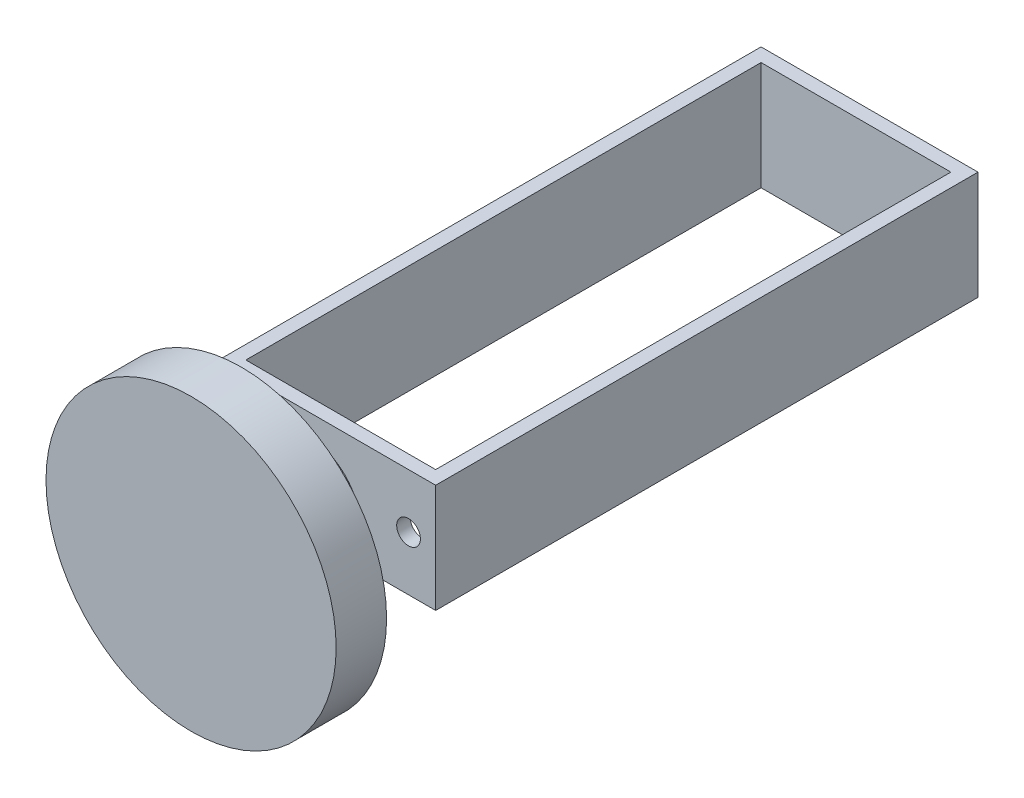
from build123d import *

# Parameters (mm, degrees)
SKETCH1_W           = 50.8
SKETCH1_H           = 127
SKETCH1_W_2         = 44.45
SKETCH1_H_2         = 120.65
BOSS_EXTRUDE1_DEPTH = 25.4
SKETCH2_R           = 2.778125
CUT_EXTRUDE1_DEPTH  = 25.4
SKETCH3_R           = 5.588
BOSS_EXTRUDE2_DEPTH = 4.826
SKETCH4_R           = 12.7
SKETCH4_R_2         = 5.588
BOSS_EXTRUDE3_DEPTH = 15.24
SKETCH5_R           = 33.9725
SKETCH5_R_2         = 12.7
BOSS_EXTRUDE4_DEPTH = 11.811


with BuildPart() as part:
    # Sketch1 → Boss-Extrude1 (new body)
    with BuildSketch(Plane(origin=(0, 0, 0), x_dir=(1, 0, 0), z_dir=(0, 1, 0))):
        Rectangle(SKETCH1_W, SKETCH1_H)
        Rectangle(SKETCH1_W_2, SKETCH1_H_2, mode=Mode.SUBTRACT)
    extrude(amount=BOSS_EXTRUDE1_DEPTH)

    # Sketch2 → Cut-Extrude1 (cut)
    with BuildSketch(Plane.XY.offset(63.5)):
        with Locations((-19.05, 12.7)):
            Circle(SKETCH2_R)
        with Locations((19.05, 12.7)):
            Circle(SKETCH2_R)
    extrude(amount=-CUT_EXTRUDE1_DEPTH, mode=Mode.SUBTRACT)

    # Sketch3 → Boss-Extrude2 (add)
    with BuildSketch(Plane.XY.offset(63.5)):
        with Locations(Location((0, 12.7, 0), (0, 0, 180))):
            Circle(SKETCH3_R)
    extrude(amount=BOSS_EXTRUDE2_DEPTH)

    # Sketch4 → Boss-Extrude3 (add)
    # profile 1 of 5: a face of its own
    with BuildSketch(Plane.XY.offset(68.326)):
        with Locations(Location((0, 12.7, 0), (0, 0, 180))):
            Circle(SKETCH4_R)
        with Locations(Location((0, 12.7, 0), (0, 0, 180))):
            Circle(SKETCH4_R_2, mode=Mode.SUBTRACT)
    # profile 2 of 5: a face of its own
    with BuildSketch(Plane.XY.offset(68.326)):
        with BuildLine():
            ThreePointArc((5.588, 12.7), (3.951312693, 16.651312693), (0, 18.288))
            Line((0, 18.288), (0, 7.112))
            ThreePointArc((0, 7.112), (3.951312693, 8.748687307), (5.588, 12.7))
        make_face()
    # profile 3 of 5: a face of its own
    with BuildSketch(Plane.XY.offset(68.326)):
        with BuildLine():
            Line((0, 7.112), (0, 18.288))
            ThreePointArc((0, 18.288), (-5.588, 12.7), (0, 7.112))
        make_face()
    # profile 4 of 5: a face of its own
    with BuildSketch(Plane.XY.offset(68.326)):
        with BuildLine():
            ThreePointArc((5.588, 12.7), (3.951312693, 16.651312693), (0, 18.288))
            Line((0, 18.288), (0, 7.112))
            ThreePointArc((0, 7.112), (3.951312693, 8.748687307), (5.588, 12.7))
        make_face()
    # profile 5 of 5: a face of its own
    with BuildSketch(Plane.XY.offset(68.326)):
        with BuildLine():
            Line((0, 7.112), (0, 18.288))
            ThreePointArc((0, 18.288), (-5.588, 12.7), (0, 7.112))
        make_face()
    extrude(amount=BOSS_EXTRUDE3_DEPTH)

    # Sketch5 → Boss-Extrude4 (add)
    # profile 1 of 5: a face of its own
    with BuildSketch(Plane.XY.offset(83.566)):
        with Locations((0, 12.7)):
            Circle(SKETCH5_R)
        with Locations(Location((0, 12.7, 0), (0, 0, 180))):
            Circle(SKETCH5_R_2, mode=Mode.SUBTRACT)
    # profile 2 of 5: a face of its own
    with BuildSketch(Plane.XY.offset(83.566)):
        with BuildLine():
            ThreePointArc((12.7, 12.7), (8.980256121, 21.680256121), (0, 25.4))
            Line((0, 25.4), (0, 0))
            ThreePointArc((0, 0), (8.980256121, 3.719743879), (12.7, 12.7))
        make_face()
    # profile 3 of 5: a face of its own
    with BuildSketch(Plane.XY.offset(83.566)):
        with BuildLine():
            Line((0, 0), (0, 25.4))
            ThreePointArc((0, 25.4), (-12.7, 12.7), (0, 0))
        make_face()
    # profile 4 of 5: a face of its own
    with BuildSketch(Plane.XY.offset(83.566)):
        with BuildLine():
            ThreePointArc((12.7, 12.7), (8.980256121, 21.680256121), (0, 25.4))
            Line((0, 25.4), (0, 0))
            ThreePointArc((0, 0), (8.980256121, 3.719743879), (12.7, 12.7))
        make_face()
    # profile 5 of 5: a face of its own
    with BuildSketch(Plane.XY.offset(83.566)):
        with BuildLine():
            Line((0, 0), (0, 25.4))
            ThreePointArc((0, 25.4), (-12.7, 12.7), (0, 0))
        make_face()
    extrude(amount=BOSS_EXTRUDE4_DEPTH)


solid = part.part
